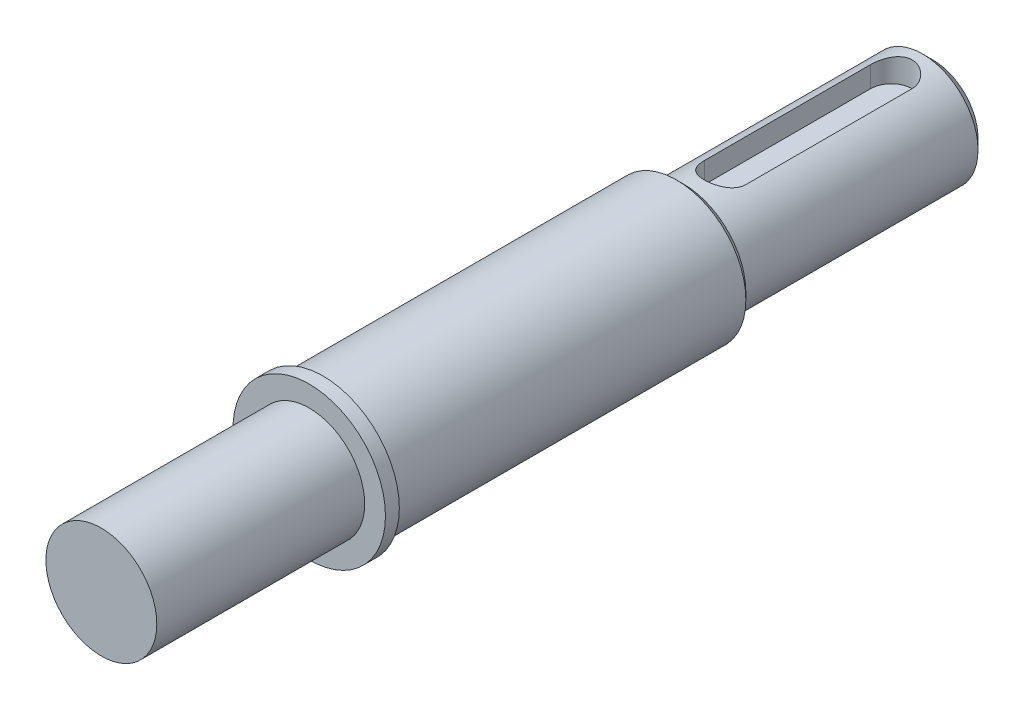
ISO-10303-21;
HEADER;
FILE_DESCRIPTION(('STEP AP214'),'2;1');
FILE_NAME('part.step','',(''),(''),'','','');
FILE_SCHEMA(('AUTOMOTIVE_DESIGN { 1 0 10303 214 1 1 1 1 }'));
ENDSEC;
DATA;
#1=APPLICATION_CONTEXT('core data for automotive mechanical design processes');
#2=APPLICATION_PROTOCOL_DEFINITION('international standard','automotive_design',2000,#1);
#3=PRODUCT_CONTEXT('',#1,'mechanical');
#4=PRODUCT('Part','Part','',(#3));
#5=PRODUCT_RELATED_PRODUCT_CATEGORY('part','',(#4));
#6=PRODUCT_DEFINITION_FORMATION('','',#4);
#7=PRODUCT_DEFINITION_CONTEXT('part definition',#1,'design');
#8=PRODUCT_DEFINITION('design','',#6,#7);
#9=PRODUCT_DEFINITION_SHAPE('','',#8);
#10=(LENGTH_UNIT() NAMED_UNIT(*) SI_UNIT(.MILLI.,.METRE.));
#11=(NAMED_UNIT(*) PLANE_ANGLE_UNIT() SI_UNIT($,.RADIAN.));
#12=(NAMED_UNIT(*) SI_UNIT($,.STERADIAN.) SOLID_ANGLE_UNIT());
#13=UNCERTAINTY_MEASURE_WITH_UNIT(LENGTH_MEASURE(1.E-05),#10,'distance_accuracy_value','');
#14=(GEOMETRIC_REPRESENTATION_CONTEXT(3) GLOBAL_UNCERTAINTY_ASSIGNED_CONTEXT((#13)) GLOBAL_UNIT_ASSIGNED_CONTEXT((#10,
#11,#12)) REPRESENTATION_CONTEXT('',''));
#15=CARTESIAN_POINT('',(0.,0.,0.));
#16=DIRECTION('',(0.,0.,1.));
#17=DIRECTION('',(1.,0.,0.));
#18=AXIS2_PLACEMENT_3D('',#15,#16,#17);
#19=CARTESIAN_POINT('',(0.,-5.34294830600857E-13,44.));
#20=DIRECTION('',(0.,0.,0.999999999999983));
#21=DIRECTION('',(1.,0.,0.));
#22=AXIS2_PLACEMENT_3D('',#19,#20,#21);
#23=PLANE('',#22);
#24=CARTESIAN_POINT('',(0.,-5.34294830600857E-13,44.));
#25=DIRECTION('',(0.,0.,0.999999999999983));
#26=DIRECTION('',(1.,0.,0.));
#27=AXIS2_PLACEMENT_3D('',#24,#25,#26);
#28=CIRCLE('',#27,5.5);
#29=CARTESIAN_POINT('',(5.5,-5.34294830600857E-13,44.));
#30=VERTEX_POINT('',#29);
#31=EDGE_CURVE('E106',#30,#30,#28,.T.);
#32=ORIENTED_EDGE('',*,*,#31,.F.);
#33=EDGE_LOOP('',(#32));
#34=FACE_BOUND('',#33,.T.);
#35=CARTESIAN_POINT('',(0.,-5.34294830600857E-13,44.));
#36=DIRECTION('',(0.,0.,0.999999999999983));
#37=DIRECTION('',(1.,0.,0.));
#38=AXIS2_PLACEMENT_3D('',#35,#36,#37);
#39=CIRCLE('',#38,5.);
#40=CARTESIAN_POINT('',(5.,-5.33888905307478E-13,44.));
#41=VERTEX_POINT('',#40);
#42=EDGE_CURVE('E192',#41,#41,#39,.F.);
#43=ORIENTED_EDGE('',*,*,#42,.F.);
#44=EDGE_LOOP('',(#43));
#45=FACE_BOUND('',#44,.T.);
#46=ADVANCED_FACE('F42',(#34,#45),#23,.F.);
#47=CARTESIAN_POINT('',(0.,-5.34294830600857E-13,44.));
#48=DIRECTION('',(0.,0.,0.999999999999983));
#49=DIRECTION('',(1.,0.,0.));
#50=AXIS2_PLACEMENT_3D('',#47,#48,#49);
#51=CYLINDRICAL_SURFACE('',#50,5.5);
#52=CARTESIAN_POINT('',(0.,-3.81639164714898E-13,45.0000000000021));
#53=DIRECTION('',(0.,0.,0.999999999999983));
#54=DIRECTION('',(1.,0.,0.));
#55=AXIS2_PLACEMENT_3D('',#52,#53,#54);
#56=CIRCLE('',#55,5.5);
#57=CARTESIAN_POINT('',(5.5,-5.34282687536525E-13,45.0000000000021));
#58=VERTEX_POINT('',#57);
#59=EDGE_CURVE('E109',#58,#58,#56,.T.);
#60=CARTESIAN_POINT('',(5.5,-5.34294830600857E-13,44.));
#61=CARTESIAN_POINT('',(5.5,-5.34294704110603E-13,44.0104166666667));
#62=CARTESIAN_POINT('',(5.5,-5.3429457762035E-13,44.0208333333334));
#63=CARTESIAN_POINT('',(5.5,-5.34294324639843E-13,44.0416666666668));
#64=CARTESIAN_POINT('',(5.5,-5.34294198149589E-13,44.0520833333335));
#65=CARTESIAN_POINT('',(5.5,-5.34293945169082E-13,44.0729166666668));
#66=CARTESIAN_POINT('',(5.5,-5.34293818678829E-13,44.0833333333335));
#67=CARTESIAN_POINT('',(5.5,-5.34293565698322E-13,44.1041666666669));
#68=CARTESIAN_POINT('',(5.5,-5.34293439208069E-13,44.1145833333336));
#69=CARTESIAN_POINT('',(5.5,-5.34293186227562E-13,44.135416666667));
#70=CARTESIAN_POINT('',(5.5,-5.34293059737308E-13,44.1458333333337));
#71=CARTESIAN_POINT('',(5.5,-5.34292806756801E-13,44.166666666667));
#72=CARTESIAN_POINT('',(5.5,-5.34292680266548E-13,44.1770833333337));
#73=CARTESIAN_POINT('',(5.5,-5.34292427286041E-13,44.1979166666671));
#74=CARTESIAN_POINT('',(5.5,-5.34292300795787E-13,44.2083333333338));
#75=CARTESIAN_POINT('',(5.5,-5.34292047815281E-13,44.2291666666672));
#76=CARTESIAN_POINT('',(5.5,-5.34291921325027E-13,44.2395833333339));
#77=CARTESIAN_POINT('',(5.5,-5.3429166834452E-13,44.2604166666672));
#78=CARTESIAN_POINT('',(5.5,-5.34291541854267E-13,44.2708333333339));
#79=CARTESIAN_POINT('',(5.5,-5.3429128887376E-13,44.2916666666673));
#80=CARTESIAN_POINT('',(5.5,-5.34291162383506E-13,44.302083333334));
#81=CARTESIAN_POINT('',(5.5,-5.34290909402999E-13,44.3229166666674));
#82=CARTESIAN_POINT('',(5.5,-5.34290782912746E-13,44.3333333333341));
#83=CARTESIAN_POINT('',(5.5,-5.34290529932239E-13,44.3541666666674));
#84=CARTESIAN_POINT('',(5.5,-5.34290403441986E-13,44.3645833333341));
#85=CARTESIAN_POINT('',(5.5,-5.34290150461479E-13,44.3854166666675));
#86=CARTESIAN_POINT('',(5.5,-5.34290023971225E-13,44.3958333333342));
#87=CARTESIAN_POINT('',(5.5,-5.34289770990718E-13,44.4166666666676));
#88=CARTESIAN_POINT('',(5.5,-5.34289644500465E-13,44.4270833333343));
#89=CARTESIAN_POINT('',(5.5,-5.34289391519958E-13,44.4479166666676));
#90=CARTESIAN_POINT('',(5.5,-5.34289265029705E-13,44.4583333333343));
#91=CARTESIAN_POINT('',(5.5,-5.34289012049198E-13,44.4791666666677));
#92=CARTESIAN_POINT('',(5.5,-5.34288885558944E-13,44.4895833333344));
#93=CARTESIAN_POINT('',(5.5,-5.34288632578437E-13,44.5104166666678));
#94=CARTESIAN_POINT('',(5.5,-5.34288506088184E-13,44.5208333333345));
#95=CARTESIAN_POINT('',(5.5,-5.34288253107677E-13,44.5416666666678));
#96=CARTESIAN_POINT('',(5.5,-5.34288126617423E-13,44.5520833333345));
#97=CARTESIAN_POINT('',(5.5,-5.34287873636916E-13,44.5729166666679));
#98=CARTESIAN_POINT('',(5.5,-5.34287747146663E-13,44.5833333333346));
#99=CARTESIAN_POINT('',(5.5,-5.34287494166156E-13,44.604166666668));
#100=CARTESIAN_POINT('',(5.5,-5.34287367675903E-13,44.6145833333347));
#101=CARTESIAN_POINT('',(5.5,-5.34287114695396E-13,44.635416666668));
#102=CARTESIAN_POINT('',(5.5,-5.34286988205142E-13,44.6458333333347));
#103=CARTESIAN_POINT('',(5.5,-5.34286735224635E-13,44.6666666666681));
#104=CARTESIAN_POINT('',(5.5,-5.34286608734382E-13,44.6770833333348));
#105=CARTESIAN_POINT('',(5.5,-5.34286355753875E-13,44.6979166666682));
#106=CARTESIAN_POINT('',(5.5,-5.34286229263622E-13,44.7083333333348));
#107=CARTESIAN_POINT('',(5.5,-5.34285976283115E-13,44.7291666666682));
#108=CARTESIAN_POINT('',(5.5,-5.34285849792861E-13,44.7395833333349));
#109=CARTESIAN_POINT('',(5.5,-5.34285596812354E-13,44.7604166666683));
#110=CARTESIAN_POINT('',(5.5,-5.34285470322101E-13,44.770833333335));
#111=CARTESIAN_POINT('',(5.5,-5.34285217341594E-13,44.7916666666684));
#112=CARTESIAN_POINT('',(5.5,-5.3428509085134E-13,44.802083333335));
#113=CARTESIAN_POINT('',(5.5,-5.34284837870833E-13,44.8229166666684));
#114=CARTESIAN_POINT('',(5.5,-5.3428471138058E-13,44.8333333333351));
#115=CARTESIAN_POINT('',(5.5,-5.34284458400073E-13,44.8541666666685));
#116=CARTESIAN_POINT('',(5.5,-5.3428433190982E-13,44.8645833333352));
#117=CARTESIAN_POINT('',(5.5,-5.34284078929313E-13,44.8854166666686));
#118=CARTESIAN_POINT('',(5.5,-5.34283952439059E-13,44.8958333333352));
#119=CARTESIAN_POINT('',(5.5,-5.34283699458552E-13,44.9166666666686));
#120=CARTESIAN_POINT('',(5.5,-5.34283572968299E-13,44.9270833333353));
#121=CARTESIAN_POINT('',(5.5,-5.34283319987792E-13,44.9479166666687));
#122=CARTESIAN_POINT('',(5.5,-5.34283193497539E-13,44.9583333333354));
#123=CARTESIAN_POINT('',(5.5,-5.34282940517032E-13,44.9791666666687));
#124=CARTESIAN_POINT('',(5.5,-5.34282814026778E-13,44.9895833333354));
#125=CARTESIAN_POINT('',(5.5,-5.34282687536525E-13,45.0000000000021));
#126=B_SPLINE_CURVE_WITH_KNOTS('',3,(#60,#61,#62,#63,#64,#65,#66,#67,#68,#69,#70,#71,#72,#73,
#74,#75,#76,#77,#78,#79,#80,#81,#82,#83,#84,#85,#86,#87,#88,#89,#90,#91,#92,#93,#94,#95,#96,#97,
#98,#99,#100,#101,#102,#103,#104,#105,#106,#107,#108,#109,#110,#111,#112,#113,#114,#115,#116,
#117,#118,#119,#120,#121,#122,#123,#124,#125),.UNSPECIFIED.,.F.,.F.,(4,2,2,2,2,2,2,2,2,2,2,2,2,
2,2,2,2,2,2,2,2,2,2,2,2,2,2,2,2,2,2,2,4),(0.,0.0312500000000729,0.0625000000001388,
0.0937500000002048,0.125000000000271,0.156250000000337,0.187500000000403,0.218750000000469,
0.250000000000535,0.2812500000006,0.312500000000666,0.343750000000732,0.375000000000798,
0.406250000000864,0.43750000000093,0.468750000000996,0.500000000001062,0.531250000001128,
0.562500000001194,0.59375000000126,0.625000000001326,0.656250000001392,0.687500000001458,
0.718750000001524,0.75000000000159,0.781250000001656,0.812500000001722,0.843750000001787,
0.875000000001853,0.906250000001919,0.937500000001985,0.968750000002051,1.00000000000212),.UNSPECIFIED.);
#127=EDGE_CURVE('BSEAM156',#30,#58,#126,.T.);
#128=ORIENTED_EDGE('',*,*,#31,.T.);
#129=ORIENTED_EDGE('',*,*,#59,.F.);
#130=ORIENTED_EDGE('',*,*,#127,.T.);
#131=ORIENTED_EDGE('',*,*,#127,.F.);
#132=EDGE_LOOP('',(#128,#130,#129,#131));
#133=FACE_BOUND('',#132,.T.);
#134=ADVANCED_FACE('F156',(#133),#51,.T.);
#135=CARTESIAN_POINT('',(0.,-3.81639164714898E-13,45.0000000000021));
#136=DIRECTION('',(0.,0.,0.999999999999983));
#137=DIRECTION('',(1.,0.,0.));
#138=AXIS2_PLACEMENT_3D('',#135,#136,#137);
#139=PLANE('',#138);
#140=CARTESIAN_POINT('',(0.,-3.81639164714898E-13,45.0000000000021));
#141=DIRECTION('',(0.,0.,0.999999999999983));
#142=DIRECTION('',(1.,0.,0.));
#143=AXIS2_PLACEMENT_3D('',#140,#141,#142);
#144=CIRCLE('',#143,4.);
#145=CARTESIAN_POINT('',(4.,0.,45.0000000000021));
#146=VERTEX_POINT('',#145);
#147=EDGE_CURVE('E12',#146,#146,#144,.T.);
#148=ORIENTED_EDGE('',*,*,#147,.F.);
#149=EDGE_LOOP('',(#148));
#150=FACE_BOUND('',#149,.T.);
#151=ORIENTED_EDGE('',*,*,#59,.T.);
#152=EDGE_LOOP('',(#151));
#153=FACE_BOUND('',#152,.T.);
#154=ADVANCED_FACE('F164',(#150,#153),#139,.T.);
#155=CARTESIAN_POINT('',(0.,-5.34294830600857E-13,18.));
#156=DIRECTION('',(0.,0.,-0.999999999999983));
#157=DIRECTION('',(-1.,0.,0.));
#158=AXIS2_PLACEMENT_3D('',#155,#156,#157);
#159=PLANE('',#158);
#160=CARTESIAN_POINT('',(0.,-5.34294830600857E-13,18.));
#161=DIRECTION('',(0.,0.,-0.999999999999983));
#162=DIRECTION('',(-1.,0.,0.));
#163=AXIS2_PLACEMENT_3D('',#160,#161,#162);
#164=CIRCLE('',#163,4.5);
#165=CARTESIAN_POINT('',(4.5,-5.34294830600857E-13,18.));
#166=VERTEX_POINT('',#165);
#167=EDGE_CURVE('E193',#166,#166,#164,.T.);
#168=ORIENTED_EDGE('',*,*,#167,.T.);
#169=EDGE_LOOP('',(#168));
#170=FACE_BOUND('',#169,.T.);
#171=CARTESIAN_POINT('',(0.,-5.34294830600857E-13,18.));
#172=DIRECTION('',(0.,0.,-0.999999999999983));
#173=DIRECTION('',(-1.,0.,0.));
#174=AXIS2_PLACEMENT_3D('',#171,#172,#173);
#175=CIRCLE('',#174,4.);
#176=CARTESIAN_POINT('',(-4.,-5.34294830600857E-13,18.));
#177=VERTEX_POINT('',#176);
#178=EDGE_CURVE('E203',#177,#177,#175,.T.);
#179=ORIENTED_EDGE('',*,*,#178,.F.);
#180=EDGE_LOOP('',(#179));
#181=FACE_BOUND('',#180,.T.);
#182=ADVANCED_FACE('F174',(#170,#181),#159,.T.);
#183=CARTESIAN_POINT('',(0.,-5.34294830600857E-13,18.));
#184=DIRECTION('',(0.,0.,0.999999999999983));
#185=DIRECTION('',(1.,0.,0.));
#186=AXIS2_PLACEMENT_3D('',#183,#184,#185);
#187=CYLINDRICAL_SURFACE('',#186,5.);
#188=CARTESIAN_POINT('',(0.,-3.33066907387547E-13,18.5000000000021));
#189=DIRECTION('',(0.,0.,-0.999999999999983));
#190=DIRECTION('',(-1.,0.,0.));
#191=AXIS2_PLACEMENT_3D('',#188,#189,#190);
#192=CIRCLE('',#191,5.);
#193=CARTESIAN_POINT('',(5.,-5.34287024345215E-13,18.5000000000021));
#194=VERTEX_POINT('',#193);
#195=EDGE_CURVE('E51',#194,#194,#192,.F.);
#196=CARTESIAN_POINT('',(5.,-5.34287024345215E-13,18.5000000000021));
#197=CARTESIAN_POINT('',(5.,-5.34282877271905E-13,18.7656250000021));
#198=CARTESIAN_POINT('',(5.,-5.34278730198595E-13,19.0312500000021));
#199=CARTESIAN_POINT('',(5.,-5.34270436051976E-13,19.562500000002));
#200=CARTESIAN_POINT('',(5.,-5.34266288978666E-13,19.828125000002));
#201=CARTESIAN_POINT('',(5.,-5.34257994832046E-13,20.359375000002));
#202=CARTESIAN_POINT('',(5.,-5.34253847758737E-13,20.625000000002));
#203=CARTESIAN_POINT('',(5.,-5.34245553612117E-13,21.1562500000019));
#204=CARTESIAN_POINT('',(5.,-5.34241406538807E-13,21.4218750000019));
#205=CARTESIAN_POINT('',(5.,-5.34233112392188E-13,21.9531250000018));
#206=CARTESIAN_POINT('',(5.,-5.34228965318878E-13,22.2187500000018));
#207=CARTESIAN_POINT('',(5.,-5.34220671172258E-13,22.7500000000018));
#208=CARTESIAN_POINT('',(5.,-5.34216524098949E-13,23.0156250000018));
#209=CARTESIAN_POINT('',(5.,-5.34208229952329E-13,23.5468750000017));
#210=CARTESIAN_POINT('',(5.,-5.3420408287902E-13,23.8125000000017));
#211=CARTESIAN_POINT('',(5.,-5.341957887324E-13,24.3437500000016));
#212=CARTESIAN_POINT('',(5.,-5.3419164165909E-13,24.6093750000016));
#213=CARTESIAN_POINT('',(5.,-5.34183347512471E-13,25.1406250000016));
#214=CARTESIAN_POINT('',(5.,-5.34179200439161E-13,25.4062500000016));
#215=CARTESIAN_POINT('',(5.,-5.34170906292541E-13,25.9375000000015));
#216=CARTESIAN_POINT('',(5.,-5.34166759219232E-13,26.2031250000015));
#217=CARTESIAN_POINT('',(5.,-5.34158465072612E-13,26.7343750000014));
#218=CARTESIAN_POINT('',(5.,-5.34154317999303E-13,27.0000000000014));
#219=CARTESIAN_POINT('',(5.,-5.34146023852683E-13,27.5312500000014));
#220=CARTESIAN_POINT('',(5.,-5.34141876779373E-13,27.7968750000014));
#221=CARTESIAN_POINT('',(5.,-5.34133582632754E-13,28.3281250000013));
#222=CARTESIAN_POINT('',(5.,-5.34129435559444E-13,28.5937500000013));
#223=CARTESIAN_POINT('',(5.,-5.34121141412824E-13,29.1250000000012));
#224=CARTESIAN_POINT('',(5.,-5.34116994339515E-13,29.3906250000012));
#225=CARTESIAN_POINT('',(5.,-5.34108700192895E-13,29.9218750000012));
#226=CARTESIAN_POINT('',(5.,-5.34104553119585E-13,30.1875000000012));
#227=CARTESIAN_POINT('',(5.,-5.34096258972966E-13,30.7187500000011));
#228=CARTESIAN_POINT('',(5.,-5.34092111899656E-13,30.9843750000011));
#229=CARTESIAN_POINT('',(5.,-5.34083817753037E-13,31.515625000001));
#230=CARTESIAN_POINT('',(5.,-5.34079670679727E-13,31.781250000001));
#231=CARTESIAN_POINT('',(5.,-5.34071376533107E-13,32.312500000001));
#232=CARTESIAN_POINT('',(5.,-5.34067229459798E-13,32.578125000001));
#233=CARTESIAN_POINT('',(5.,-5.34058935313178E-13,33.1093750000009));
#234=CARTESIAN_POINT('',(5.,-5.34054788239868E-13,33.3750000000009));
#235=CARTESIAN_POINT('',(5.,-5.34046494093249E-13,33.9062500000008));
#236=CARTESIAN_POINT('',(5.,-5.34042347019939E-13,34.1718750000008));
#237=CARTESIAN_POINT('',(5.,-5.3403405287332E-13,34.7031250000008));
#238=CARTESIAN_POINT('',(5.,-5.3402990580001E-13,34.9687500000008));
#239=CARTESIAN_POINT('',(5.,-5.3402161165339E-13,35.5000000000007));
#240=CARTESIAN_POINT('',(5.,-5.3401746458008E-13,35.7656250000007));
#241=CARTESIAN_POINT('',(5.,-5.34009170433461E-13,36.2968750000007));
#242=CARTESIAN_POINT('',(5.,-5.34005023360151E-13,36.5625000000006));
#243=CARTESIAN_POINT('',(5.,-5.33996729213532E-13,37.0937500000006));
#244=CARTESIAN_POINT('',(5.,-5.33992582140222E-13,37.3593750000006));
#245=CARTESIAN_POINT('',(5.,-5.33984287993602E-13,37.8906250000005));
#246=CARTESIAN_POINT('',(5.,-5.33980140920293E-13,38.1562500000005));
#247=CARTESIAN_POINT('',(5.,-5.33971846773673E-13,38.6875000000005));
#248=CARTESIAN_POINT('',(5.,-5.33967699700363E-13,38.9531250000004));
#249=CARTESIAN_POINT('',(5.,-5.33959405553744E-13,39.4843750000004));
#250=CARTESIAN_POINT('',(5.,-5.33955258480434E-13,39.7500000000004));
#251=CARTESIAN_POINT('',(5.,-5.33946964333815E-13,40.2812500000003));
#252=CARTESIAN_POINT('',(5.,-5.33942817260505E-13,40.5468750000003));
#253=CARTESIAN_POINT('',(5.,-5.33934523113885E-13,41.0781250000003));
#254=CARTESIAN_POINT('',(5.,-5.33930376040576E-13,41.3437500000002));
#255=CARTESIAN_POINT('',(5.,-5.33922081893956E-13,41.8750000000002));
#256=CARTESIAN_POINT('',(5.,-5.33917934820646E-13,42.1406250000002));
#257=CARTESIAN_POINT('',(5.,-5.33909640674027E-13,42.6718750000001));
#258=CARTESIAN_POINT('',(5.,-5.33905493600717E-13,42.9375000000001));
#259=CARTESIAN_POINT('',(5.,-5.33897199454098E-13,43.4687500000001));
#260=CARTESIAN_POINT('',(5.,-5.33893052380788E-13,43.734375));
#261=CARTESIAN_POINT('',(5.,-5.33888905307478E-13,44.));
#262=B_SPLINE_CURVE_WITH_KNOTS('',3,(#196,#197,#198,#199,#200,#201,#202,#203,#204,#205,#206,
#207,#208,#209,#210,#211,#212,#213,#214,#215,#216,#217,#218,#219,#220,#221,#222,#223,#224,#225,
#226,#227,#228,#229,#230,#231,#232,#233,#234,#235,#236,#237,#238,#239,#240,#241,#242,#243,#244,
#245,#246,#247,#248,#249,#250,#251,#252,#253,#254,#255,#256,#257,#258,#259,#260,#261),
.UNSPECIFIED.,.F.,.F.,(4,2,2,2,2,2,2,2,2,2,2,2,2,2,2,2,2,2,2,2,2,2,2,2,2,2,2,2,2,2,2,2,4),(0.,
0.796874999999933,1.59374999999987,2.3906249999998,3.18749999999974,3.98437499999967,
4.7812499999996,5.57812499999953,6.37499999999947,7.1718749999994,7.96874999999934,
8.76562499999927,9.56249999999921,10.3593749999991,11.1562499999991,11.953124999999,
12.7499999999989,13.5468749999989,14.3437499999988,15.1406249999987,15.9374999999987,
16.7343749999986,17.5312499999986,18.3281249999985,19.1249999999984,19.9218749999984,
20.7187499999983,21.5156249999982,22.3124999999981,23.1093749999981,23.906249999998,
24.703124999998,25.4999999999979),.UNSPECIFIED.);
#263=EDGE_CURVE('BSEAM170',#194,#41,#262,.T.);
#264=ORIENTED_EDGE('',*,*,#195,.T.);
#265=ORIENTED_EDGE('',*,*,#42,.T.);
#266=ORIENTED_EDGE('',*,*,#263,.T.);
#267=ORIENTED_EDGE('',*,*,#263,.F.);
#268=EDGE_LOOP('',(#264,#266,#265,#267));
#269=FACE_BOUND('',#268,.T.);
#270=ADVANCED_FACE('F170',(#269),#187,.T.);
#271=CARTESIAN_POINT('',(0.,2.2,3.));
#272=DIRECTION('',(0.,-1.,0.));
#273=DIRECTION('',(0.,0.,-0.999999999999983));
#274=AXIS2_PLACEMENT_3D('',#271,#272,#273);
#275=PLANE('',#274);
#276=CARTESIAN_POINT('',(0.,2.2,3.));
#277=DIRECTION('',(0.,1.,0.));
#278=DIRECTION('',(0.,0.,-0.999999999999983));
#279=AXIS2_PLACEMENT_3D('',#276,#277,#278);
#280=CIRCLE('',#279,1.5);
#281=CARTESIAN_POINT('',(1.5,2.2,3.));
#282=VERTEX_POINT('',#281);
#283=CARTESIAN_POINT('',(-1.5,2.2,3.));
#284=VERTEX_POINT('',#283);
#285=EDGE_CURVE('E87',#282,#284,#280,.T.);
#286=ORIENTED_EDGE('',*,*,#285,.T.);
#287=DIRECTION('',(0.,0.,0.999999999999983));
#288=VECTOR('',#287,1.);
#289=CARTESIAN_POINT('',(-1.5,2.2,3.));
#290=LINE('',#289,#288);
#291=CARTESIAN_POINT('',(-1.5,2.19999999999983,15.0000000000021));
#292=VERTEX_POINT('',#291);
#293=EDGE_CURVE('E95',#284,#292,#290,.T.);
#294=ORIENTED_EDGE('',*,*,#293,.T.);
#295=CARTESIAN_POINT('',(0.,2.19999999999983,15.0000000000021));
#296=DIRECTION('',(0.,1.,0.));
#297=DIRECTION('',(0.,0.,0.999999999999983));
#298=AXIS2_PLACEMENT_3D('',#295,#296,#297);
#299=CIRCLE('',#298,1.5);
#300=CARTESIAN_POINT('',(1.5,2.19999999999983,15.0000000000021));
#301=VERTEX_POINT('',#300);
#302=EDGE_CURVE('E101',#292,#301,#299,.T.);
#303=ORIENTED_EDGE('',*,*,#302,.T.);
#304=DIRECTION('',(0.,0.,-0.999999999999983));
#305=VECTOR('',#304,1.);
#306=CARTESIAN_POINT('',(1.5,2.2,3.));
#307=LINE('',#306,#305);
#308=EDGE_CURVE('E105',#301,#282,#307,.T.);
#309=ORIENTED_EDGE('',*,*,#308,.T.);
#310=EDGE_LOOP('',(#286,#294,#303,#309));
#311=FACE_BOUND('',#310,.T.);
#312=ADVANCED_FACE('F104',(#311),#275,.F.);
#313=CARTESIAN_POINT('',(0.,0.,0.));
#314=DIRECTION('',(0.,0.,0.999999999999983));
#315=DIRECTION('',(1.,0.,0.));
#316=AXIS2_PLACEMENT_3D('',#313,#314,#315);
#317=PLANE('',#316);
#318=CARTESIAN_POINT('',(0.,0.,0.));
#319=DIRECTION('',(0.,0.,0.999999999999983));
#320=DIRECTION('',(1.,0.,0.));
#321=AXIS2_PLACEMENT_3D('',#318,#319,#320);
#322=CIRCLE('',#321,3.25);
#323=CARTESIAN_POINT('',(3.24999999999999,0.,0.));
#324=VERTEX_POINT('',#323);
#325=EDGE_CURVE('E194',#324,#324,#322,.F.);
#326=ORIENTED_EDGE('',*,*,#325,.T.);
#327=EDGE_LOOP('',(#326));
#328=FACE_BOUND('',#327,.T.);
#329=ADVANCED_FACE('F133',(#328),#317,.F.);
#330=CARTESIAN_POINT('',(0.,3.99999999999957,15.0000000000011));
#331=DIRECTION('',(0.,-1.,0.));
#332=DIRECTION('',(0.,0.,-0.999999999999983));
#333=AXIS2_PLACEMENT_3D('',#330,#331,#332);
#334=CYLINDRICAL_SURFACE('',#333,1.5);
#335=DIRECTION('',(0.,-1.,0.));
#336=VECTOR('',#335,1.);
#337=CARTESIAN_POINT('',(-1.5,3.99999999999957,15.0000000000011));
#338=LINE('',#337,#336);
#339=CARTESIAN_POINT('',(-1.5,3.70809924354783,15.));
#340=VERTEX_POINT('',#339);
#341=EDGE_CURVE('E92',#340,#292,#338,.T.);
#342=ORIENTED_EDGE('',*,*,#341,.F.);
#343=CARTESIAN_POINT('',(0.,3.99999999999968,13.5000000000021));
#344=CARTESIAN_POINT('',(-0.0812350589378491,4.0000021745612,13.499997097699));
#345=CARTESIAN_POINT('',(-0.162450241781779,3.99750379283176,13.50661976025));
#346=CARTESIAN_POINT('',(-0.322453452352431,3.98778696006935,13.5328281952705));
#347=CARTESIAN_POINT('',(-0.401241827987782,3.98056918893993,13.5524121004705));
#348=CARTESIAN_POINT('',(-0.55406078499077,3.96218832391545,13.6037530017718));
#349=CARTESIAN_POINT('',(-0.628100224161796,3.95103284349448,13.6354865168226));
#350=CARTESIAN_POINT('',(-0.769799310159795,3.92588767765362,13.7101064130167));
#351=CARTESIAN_POINT('',(-0.837457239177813,3.91189723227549,13.7529957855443));
#352=CARTESIAN_POINT('',(-0.967346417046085,3.88186246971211,13.8506125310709));
#353=CARTESIAN_POINT('',(-1.02927073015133,3.86576002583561,13.90573026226));
#354=CARTESIAN_POINT('',(-1.14324421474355,3.83360220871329,14.0254104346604));
#355=CARTESIAN_POINT('',(-1.19529036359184,3.81754685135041,14.0899757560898));
#356=CARTESIAN_POINT('',(-1.28998202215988,3.78662470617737,14.2297174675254));
#357=CARTESIAN_POINT('',(-1.33219393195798,3.77182648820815,14.3052043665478));
#358=CARTESIAN_POINT('',(-1.40318646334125,3.74599860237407,14.4628483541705));
#359=CARTESIAN_POINT('',(-1.43197244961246,3.73496742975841,14.5450027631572));
#360=CARTESIAN_POINT('',(-1.47408431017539,3.71854412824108,14.7101167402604));
#361=CARTESIAN_POINT('',(-1.48799593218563,3.71293924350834,14.7929050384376));
#362=CARTESIAN_POINT('',(-1.50179556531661,3.70738061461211,14.959816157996));
#363=CARTESIAN_POINT('',(-1.50168936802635,3.70742453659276,15.0439384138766));
#364=CARTESIAN_POINT('',(-1.48790429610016,3.71297511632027,15.2057695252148));
#365=CARTESIAN_POINT('',(-1.47503808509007,3.71815468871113,15.2835609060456));
#366=CARTESIAN_POINT('',(-1.43744167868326,3.73284938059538,15.435787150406));
#367=CARTESIAN_POINT('',(-1.4127096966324,3.74236515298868,15.5102215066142));
#368=CARTESIAN_POINT('',(-1.35163748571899,3.76485702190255,15.6552770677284));
#369=CARTESIAN_POINT('',(-1.31508648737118,3.7778951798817,15.7257994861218));
#370=CARTESIAN_POINT('',(-1.23156073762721,3.80594210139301,15.8599457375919));
#371=CARTESIAN_POINT('',(-1.18458238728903,3.82095154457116,15.9235671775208));
#372=CARTESIAN_POINT('',(-1.07781780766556,3.85248038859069,16.046603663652));
#373=CARTESIAN_POINT('',(-1.01738298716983,3.86903347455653,16.1054486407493));
#374=CARTESIAN_POINT('',(-0.887312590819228,3.90091728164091,16.2123379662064));
#375=CARTESIAN_POINT('',(-0.817675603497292,3.91624781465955,16.2603806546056));
#376=CARTESIAN_POINT('',(-0.669723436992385,3.94426394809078,16.3449303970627));
#377=CARTESIAN_POINT('',(-0.591290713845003,3.95690498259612,16.3812475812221));
#378=CARTESIAN_POINT('',(-0.428836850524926,3.97778718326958,16.4399826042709));
#379=CARTESIAN_POINT('',(-0.344818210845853,3.98603030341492,16.462406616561));
#380=CARTESIAN_POINT('',(-0.178375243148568,3.99684443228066,16.491622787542));
#381=CARTESIAN_POINT('',(-0.0961036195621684,3.99969369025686,16.4991826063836));
#382=CARTESIAN_POINT('',(0.0685724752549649,4.00025893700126,16.500691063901));
#383=CARTESIAN_POINT('',(0.15097691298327,3.99797606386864,16.4946427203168));
#384=CARTESIAN_POINT('',(0.310262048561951,3.98871709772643,16.4696899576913));
#385=CARTESIAN_POINT('',(0.387233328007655,3.98192470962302,16.4512884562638));
#386=CARTESIAN_POINT('',(0.536941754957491,3.96451477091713,16.4028139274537));
#387=CARTESIAN_POINT('',(0.609678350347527,3.95389672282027,16.3727393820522));
#388=CARTESIAN_POINT('',(0.751247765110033,3.92949624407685,16.3008135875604));
#389=CARTESIAN_POINT('',(0.819903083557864,3.91563000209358,16.2586422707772));
#390=CARTESIAN_POINT('',(0.949392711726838,3.88626671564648,16.1640818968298));
#391=CARTESIAN_POINT('',(1.01022412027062,3.87076907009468,16.1116890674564));
#392=CARTESIAN_POINT('',(1.12603079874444,3.83873329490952,15.9945958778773));
#393=CARTESIAN_POINT('',(1.18046154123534,3.82218696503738,15.9293578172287));
#394=CARTESIAN_POINT('',(1.27771050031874,3.79078815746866,15.790348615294));
#395=CARTESIAN_POINT('',(1.32052767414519,3.77593583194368,15.7165767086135));
#396=CARTESIAN_POINT('',(1.39337773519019,3.7496682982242,15.5619840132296));
#397=CARTESIAN_POINT('',(1.42335685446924,3.73826760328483,15.481135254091));
#398=CARTESIAN_POINT('',(1.46907883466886,3.72054032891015,15.3149902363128));
#399=CARTESIAN_POINT('',(1.48483050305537,3.71421061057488,15.2296967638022));
#400=CARTESIAN_POINT('',(1.50086347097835,3.70775894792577,15.0629838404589));
#401=CARTESIAN_POINT('',(1.50207331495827,3.70726444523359,14.9816673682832));
#402=CARTESIAN_POINT('',(1.49136715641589,3.7115841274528,14.8200546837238));
#403=CARTESIAN_POINT('',(1.47945239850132,3.71639780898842,14.7397583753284));
#404=CARTESIAN_POINT('',(1.44355815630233,3.73048141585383,14.5849527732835));
#405=CARTESIAN_POINT('',(1.41995798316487,3.73961085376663,14.5103416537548));
#406=CARTESIAN_POINT('',(1.36169696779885,3.76121548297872,14.3660944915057));
#407=CARTESIAN_POINT('',(1.32703332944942,3.77369151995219,14.2964597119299));
#408=CARTESIAN_POINT('',(1.24552075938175,3.80139723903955,14.1601732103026));
#409=CARTESIAN_POINT('',(1.19812832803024,3.81673698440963,14.0938692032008));
#410=CARTESIAN_POINT('',(1.09334485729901,3.84806246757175,13.9698584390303));
#411=CARTESIAN_POINT('',(1.03595064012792,3.86404840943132,13.9121544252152));
#412=CARTESIAN_POINT('',(0.909080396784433,3.89590424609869,13.8037980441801));
#413=CARTESIAN_POINT('',(0.839118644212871,3.91172104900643,13.7536962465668));
#414=CARTESIAN_POINT('',(0.691213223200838,3.94054514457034,13.665977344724));
#415=CARTESIAN_POINT('',(0.613268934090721,3.95355221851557,13.6283612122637));
#416=CARTESIAN_POINT('',(0.447999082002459,3.97574292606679,13.5656231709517));
#417=CARTESIAN_POINT('',(0.360413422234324,3.98473657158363,13.5411129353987));
#418=CARTESIAN_POINT('',(0.18187573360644,3.99686242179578,13.5083070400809));
#419=CARTESIAN_POINT('',(0.0909254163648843,3.99999756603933,13.5000032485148));
#420=CARTESIAN_POINT('',(0.,3.99999999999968,13.5000000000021));
#421=B_SPLINE_CURVE_WITH_KNOTS('',3,(#343,#344,#345,#346,#347,#348,#349,#350,#351,#352,#353,
#354,#355,#356,#357,#358,#359,#360,#361,#362,#363,#364,#365,#366,#367,#368,#369,#370,#371,#372,
#373,#374,#375,#376,#377,#378,#379,#380,#381,#382,#383,#384,#385,#386,#387,#388,#389,#390,#391,
#392,#393,#394,#395,#396,#397,#398,#399,#400,#401,#402,#403,#404,#405,#406,#407,#408,#409,#410,
#411,#412,#413,#414,#415,#416,#417,#418,#419,#420),.UNSPECIFIED.,.T.,.F.,(4,2,2,2,2,2,2,2,2,2,2,
2,2,2,2,2,2,2,2,2,2,2,2,2,2,2,2,2,2,2,2,2,2,2,2,2,2,2,4),(0.,0.24336980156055,0.486704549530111,
0.729571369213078,0.972503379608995,1.2247361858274,1.47704604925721,1.73896674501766,
2.00078269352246,2.25185874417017,2.50283106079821,2.73878345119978,2.974771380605,
3.21522408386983,3.45575990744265,3.71246153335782,3.96920257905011,4.22991375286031,
4.49050899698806,4.73725019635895,4.98393668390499,5.22114437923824,5.45838293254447,
5.70259221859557,5.94689180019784,6.20536519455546,6.46386178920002,6.72343066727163,
6.98283874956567,7.22558763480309,7.46831350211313,7.70363142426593,7.9390088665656,
8.18672471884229,8.43451941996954,8.69572329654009,8.95694749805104,9.22948515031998,
9.5018860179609),.UNSPECIFIED.);
#422=CARTESIAN_POINT('',(1.5,3.70809924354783,15.));
#423=VERTEX_POINT('',#422);
#424=EDGE_CURVE('E91',#340,#423,#421,.T.);
#425=ORIENTED_EDGE('',*,*,#424,.T.);
#426=DIRECTION('',(0.,-1.,0.));
#427=VECTOR('',#426,1.);
#428=CARTESIAN_POINT('',(1.5,3.99999999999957,15.0000000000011));
#429=LINE('',#428,#427);
#430=EDGE_CURVE('E58',#423,#301,#429,.T.);
#431=ORIENTED_EDGE('',*,*,#430,.T.);
#432=ORIENTED_EDGE('',*,*,#302,.F.);
#433=EDGE_LOOP('',(#342,#425,#431,#432));
#434=FACE_BOUND('',#433,.T.);
#435=ADVANCED_FACE('F127',(#434),#334,.F.);
#436=CARTESIAN_POINT('',(1.5,3.99999999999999,2.99999999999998));
#437=DIRECTION('',(-1.,0.,0.));
#438=DIRECTION('',(0.,0.,0.999999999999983));
#439=AXIS2_PLACEMENT_3D('',#436,#437,#438);
#440=PLANE('',#439);
#441=DIRECTION('',(0.,0.,-0.999999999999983));
#442=VECTOR('',#441,1.);
#443=CARTESIAN_POINT('',(1.5,3.70809924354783,60.));
#444=LINE('',#443,#442);
#445=CARTESIAN_POINT('',(1.5,3.70809924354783,3.));
#446=VERTEX_POINT('',#445);
#447=EDGE_CURVE('E223',#423,#446,#444,.T.);
#448=ORIENTED_EDGE('',*,*,#447,.T.);
#449=DIRECTION('',(0.,-1.,0.));
#450=VECTOR('',#449,1.);
#451=CARTESIAN_POINT('',(1.5,3.99999999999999,2.99999999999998));
#452=LINE('',#451,#450);
#453=EDGE_CURVE('E115',#446,#282,#452,.T.);
#454=ORIENTED_EDGE('',*,*,#453,.T.);
#455=ORIENTED_EDGE('',*,*,#308,.F.);
#456=ORIENTED_EDGE('',*,*,#430,.F.);
#457=EDGE_LOOP('',(#448,#454,#455,#456));
#458=FACE_BOUND('',#457,.T.);
#459=ADVANCED_FACE('F132',(#458),#440,.T.);
#460=CARTESIAN_POINT('',(0.,3.99999999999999,3.));
#461=DIRECTION('',(0.,-1.,0.));
#462=DIRECTION('',(0.,0.,-0.999999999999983));
#463=AXIS2_PLACEMENT_3D('',#460,#461,#462);
#464=CYLINDRICAL_SURFACE('',#463,1.5);
#465=CARTESIAN_POINT('',(0.,3.99999999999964,1.50000000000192));
#466=CARTESIAN_POINT('',(-0.0812350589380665,4.00000217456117,1.49999709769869));
#467=CARTESIAN_POINT('',(-0.162450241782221,3.99750379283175,1.50661976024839));
#468=CARTESIAN_POINT('',(-0.322453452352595,3.98778696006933,1.53282819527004));
#469=CARTESIAN_POINT('',(-0.40124182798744,3.98056918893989,1.55241210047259));
#470=CARTESIAN_POINT('',(-0.554060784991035,3.96218832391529,1.603753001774));
#471=CARTESIAN_POINT('',(-0.628100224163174,3.95103284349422,1.63548651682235));
#472=CARTESIAN_POINT('',(-0.769799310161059,3.92588767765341,1.71010641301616));
#473=CARTESIAN_POINT('',(-0.837457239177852,3.91189723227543,1.75299578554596));
#474=CARTESIAN_POINT('',(-0.967346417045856,3.88186246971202,1.85061253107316));
#475=CARTESIAN_POINT('',(-1.02927073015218,3.86576002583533,1.90573026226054));
#476=CARTESIAN_POINT('',(-1.14324421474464,3.83360220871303,2.02541043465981));
#477=CARTESIAN_POINT('',(-1.19529036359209,3.81754685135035,2.08997575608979));
#478=CARTESIAN_POINT('',(-1.28998202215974,3.78662470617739,2.2297174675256));
#479=CARTESIAN_POINT('',(-1.33219393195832,3.77182648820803,2.30520436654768));
#480=CARTESIAN_POINT('',(-1.4031864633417,3.74599860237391,2.4628483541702));
#481=CARTESIAN_POINT('',(-1.43197244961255,3.73496742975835,2.54500276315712));
#482=CARTESIAN_POINT('',(-1.47408431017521,3.71854412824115,2.7101167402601));
#483=CARTESIAN_POINT('',(-1.48799593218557,3.71293924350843,2.79290503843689));
#484=CARTESIAN_POINT('',(-1.50179556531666,3.70738061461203,2.95981615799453));
#485=CARTESIAN_POINT('',(-1.50168936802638,3.7074245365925,3.04393841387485));
#486=CARTESIAN_POINT('',(-1.48790429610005,3.71297511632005,3.20576952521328));
#487=CARTESIAN_POINT('',(-1.47503808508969,3.71815468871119,3.28356090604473));
#488=CARTESIAN_POINT('',(-1.43744167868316,3.7328493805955,3.43578715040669));
#489=CARTESIAN_POINT('',(-1.41270969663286,3.74236515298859,3.51022150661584));
#490=CARTESIAN_POINT('',(-1.3516374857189,3.76485702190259,3.6552770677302));
#491=CARTESIAN_POINT('',(-1.31508648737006,3.77789517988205,3.7257994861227));
#492=CARTESIAN_POINT('',(-1.23156073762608,3.80594210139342,3.85994573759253));
#493=CARTESIAN_POINT('',(-1.18458238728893,3.82095154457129,3.923567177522));
#494=CARTESIAN_POINT('',(-1.07781780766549,3.85248038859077,4.04660366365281));
#495=CARTESIAN_POINT('',(-1.01738298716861,3.86903347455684,4.1054486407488));
#496=CARTESIAN_POINT('',(-0.887312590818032,3.90091728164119,4.21233796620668));
#497=CARTESIAN_POINT('',(-0.817675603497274,3.91624781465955,4.26038065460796));
#498=CARTESIAN_POINT('',(-0.669723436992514,3.94426394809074,4.34493039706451));
#499=CARTESIAN_POINT('',(-0.591290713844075,3.95690498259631,4.3812475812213));
#500=CARTESIAN_POINT('',(-0.428836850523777,3.97778718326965,4.43998260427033));
#501=CARTESIAN_POINT('',(-0.344818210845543,3.98603030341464,4.46240661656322));
#502=CARTESIAN_POINT('',(-0.178375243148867,3.99684443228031,4.49162278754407));
#503=CARTESIAN_POINT('',(-0.0961036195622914,3.99969369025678,4.49918260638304));
#504=CARTESIAN_POINT('',(0.0685724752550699,4.00025893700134,4.50069106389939));
#505=CARTESIAN_POINT('',(0.150976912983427,3.99797606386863,4.49464272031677));
#506=CARTESIAN_POINT('',(0.310262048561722,3.98871709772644,4.46968995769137));
#507=CARTESIAN_POINT('',(0.387233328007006,3.98192470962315,4.45128845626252));
#508=CARTESIAN_POINT('',(0.536941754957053,3.96451477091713,4.40281392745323));
#509=CARTESIAN_POINT('',(0.609678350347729,3.95389672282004,4.37273938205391));
#510=CARTESIAN_POINT('',(0.751247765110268,3.92949624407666,4.30081358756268));
#511=CARTESIAN_POINT('',(0.819903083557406,3.91563000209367,4.25864227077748));
#512=CARTESIAN_POINT('',(0.949392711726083,3.88626671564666,4.16408189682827));
#513=CARTESIAN_POINT('',(1.01022412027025,3.87076907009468,4.11168906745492));
#514=CARTESIAN_POINT('',(1.12603079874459,3.83873329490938,3.99459587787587));
#515=CARTESIAN_POINT('',(1.18046154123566,3.8221869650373,3.92935781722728));
#516=CARTESIAN_POINT('',(1.277710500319,3.79078815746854,3.79034861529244));
#517=CARTESIAN_POINT('',(1.32052767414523,3.77593583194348,3.7165767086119));
#518=CARTESIAN_POINT('',(1.39337773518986,3.74966829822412,3.56198401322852));
#519=CARTESIAN_POINT('',(1.42335685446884,3.73826760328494,3.48113525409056));
#520=CARTESIAN_POINT('',(1.46907883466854,3.72054032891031,3.31499023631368));
#521=CARTESIAN_POINT('',(1.48483050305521,3.71421061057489,3.22969676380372));
#522=CARTESIAN_POINT('',(1.50086347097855,3.70775894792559,3.06298384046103));
#523=CARTESIAN_POINT('',(1.5020733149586,3.70726444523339,2.98166736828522));
#524=CARTESIAN_POINT('',(1.49136715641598,3.71158412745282,2.82005468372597));
#525=CARTESIAN_POINT('',(1.47945239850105,3.71639780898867,2.73975837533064));
#526=CARTESIAN_POINT('',(1.44355815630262,3.73048141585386,2.58495277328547));
#527=CARTESIAN_POINT('',(1.41995798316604,3.73961085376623,2.51034165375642));
#528=CARTESIAN_POINT('',(1.36169696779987,3.7612154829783,2.36609449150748));
#529=CARTESIAN_POINT('',(1.3270333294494,3.77369151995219,2.29645971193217));
#530=CARTESIAN_POINT('',(1.24552075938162,3.80139723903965,2.16017321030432));
#531=CARTESIAN_POINT('',(1.19812832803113,3.81673698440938,2.09386920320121));
#532=CARTESIAN_POINT('',(1.09334485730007,3.84806246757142,1.96985843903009));
#533=CARTESIAN_POINT('',(1.03595064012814,3.86404840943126,1.91215442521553));
#534=CARTESIAN_POINT('',(0.90908039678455,3.89590424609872,1.8037980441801));
#535=CARTESIAN_POINT('',(0.839118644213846,3.91172104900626,1.75369624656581));
#536=CARTESIAN_POINT('',(0.691213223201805,3.94054514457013,1.66597734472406));
#537=CARTESIAN_POINT('',(0.613268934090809,3.95355221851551,1.62836121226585));
#538=CARTESIAN_POINT('',(0.447999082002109,3.97574292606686,1.56562317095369));
#539=CARTESIAN_POINT('',(0.360413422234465,3.98473657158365,1.54111293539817));
#540=CARTESIAN_POINT('',(0.18187573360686,3.99686242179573,1.5083070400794));
#541=CARTESIAN_POINT('',(0.090925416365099,3.99999756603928,1.50000324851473));
#542=CARTESIAN_POINT('',(0.,3.99999999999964,1.50000000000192));
#543=B_SPLINE_CURVE_WITH_KNOTS('',3,(#465,#466,#467,#468,#469,#470,#471,#472,#473,#474,#475,
#476,#477,#478,#479,#480,#481,#482,#483,#484,#485,#486,#487,#488,#489,#490,#491,#492,#493,#494,
#495,#496,#497,#498,#499,#500,#501,#502,#503,#504,#505,#506,#507,#508,#509,#510,#511,#512,#513,
#514,#515,#516,#517,#518,#519,#520,#521,#522,#523,#524,#525,#526,#527,#528,#529,#530,#531,#532,
#533,#534,#535,#536,#537,#538,#539,#540,#541,#542),.UNSPECIFIED.,.T.,.F.,(4,2,2,2,2,2,2,2,2,2,2,
2,2,2,2,2,2,2,2,2,2,2,2,2,2,2,2,2,2,2,2,2,2,2,2,2,2,2,4),(0.,0.243369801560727,
0.486704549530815,0.729571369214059,0.97250337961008,1.22473618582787,1.47704604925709,
1.73896674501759,2.00078269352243,2.25185874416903,2.50283106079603,2.7387834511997,
2.9747713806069,3.21522408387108,3.45575990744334,3.71246153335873,3.96920257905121,
4.22991375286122,4.49050899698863,4.73725019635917,4.9839366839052,5.22114437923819,
5.45838293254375,5.70259221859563,5.94689180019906,6.20536519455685,6.46386178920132,
6.72343066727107,6.98283874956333,7.2255876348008,7.46831350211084,7.70363142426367,
7.9390088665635,8.18672471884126,8.43451941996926,8.69572329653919,8.95694749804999,
9.22948515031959,9.50188601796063),.UNSPECIFIED.);
#544=CARTESIAN_POINT('',(-1.5,3.70809924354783,3.));
#545=VERTEX_POINT('',#544);
#546=EDGE_CURVE('E66',#446,#545,#543,.T.);
#547=ORIENTED_EDGE('',*,*,#546,.T.);
#548=DIRECTION('',(0.,-1.,0.));
#549=VECTOR('',#548,1.);
#550=CARTESIAN_POINT('',(-1.5,3.99999999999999,3.));
#551=LINE('',#550,#549);
#552=EDGE_CURVE('E83',#545,#284,#551,.T.);
#553=ORIENTED_EDGE('',*,*,#552,.T.);
#554=ORIENTED_EDGE('',*,*,#285,.F.);
#555=ORIENTED_EDGE('',*,*,#453,.F.);
#556=EDGE_LOOP('',(#547,#553,#554,#555));
#557=FACE_BOUND('',#556,.T.);
#558=ADVANCED_FACE('F85',(#557),#464,.F.);
#559=CARTESIAN_POINT('',(-1.5,3.99999999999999,3.));
#560=DIRECTION('',(1.,0.,0.));
#561=DIRECTION('',(0.,0.,-0.999999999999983));
#562=AXIS2_PLACEMENT_3D('',#559,#560,#561);
#563=PLANE('',#562);
#564=DIRECTION('',(0.,0.,-0.999999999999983));
#565=VECTOR('',#564,1.);
#566=CARTESIAN_POINT('',(-1.5,3.70809924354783,60.));
#567=LINE('',#566,#565);
#568=EDGE_CURVE('E221',#545,#340,#567,.F.);
#569=ORIENTED_EDGE('',*,*,#568,.T.);
#570=ORIENTED_EDGE('',*,*,#341,.T.);
#571=ORIENTED_EDGE('',*,*,#293,.F.);
#572=ORIENTED_EDGE('',*,*,#552,.F.);
#573=EDGE_LOOP('',(#569,#570,#571,#572));
#574=FACE_BOUND('',#573,.T.);
#575=ADVANCED_FACE('F96',(#574),#563,.T.);
#576=CARTESIAN_POINT('',(0.,0.,0.750000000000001));
#577=DIRECTION('',(0.,0.,0.999999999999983));
#578=DIRECTION('',(1.,0.,0.));
#579=AXIS2_PLACEMENT_3D('',#576,#577,#578);
#580=CONICAL_SURFACE('',#579,4.,0.785398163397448);
#581=CARTESIAN_POINT('',(0.,0.,0.750000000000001));
#582=DIRECTION('',(0.,0.,0.999999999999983));
#583=DIRECTION('',(1.,0.,0.));
#584=AXIS2_PLACEMENT_3D('',#581,#582,#583);
#585=CIRCLE('',#584,4.);
#586=CARTESIAN_POINT('',(4.,0.,0.750000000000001));
#587=VERTEX_POINT('',#586);
#588=EDGE_CURVE('E199',#587,#587,#585,.T.);
#589=CARTESIAN_POINT('',(3.24999999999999,0.,0.));
#590=CARTESIAN_POINT('',(3.25781249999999,0.,0.00781249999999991));
#591=CARTESIAN_POINT('',(3.26562499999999,0.,0.015625));
#592=CARTESIAN_POINT('',(3.28124999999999,0.,0.0312500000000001));
#593=CARTESIAN_POINT('',(3.28906249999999,0.,0.0390625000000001));
#594=CARTESIAN_POINT('',(3.30468749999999,0.,0.0546875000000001));
#595=CARTESIAN_POINT('',(3.31249999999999,0.,0.0625000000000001));
#596=CARTESIAN_POINT('',(3.32812499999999,0.,0.0781250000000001));
#597=CARTESIAN_POINT('',(3.33593749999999,0.,0.0859375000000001));
#598=CARTESIAN_POINT('',(3.35156249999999,0.,0.1015625));
#599=CARTESIAN_POINT('',(3.35937499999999,0.,0.109375));
#600=CARTESIAN_POINT('',(3.37499999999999,0.,0.125));
#601=CARTESIAN_POINT('',(3.38281249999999,0.,0.1328125));
#602=CARTESIAN_POINT('',(3.39843749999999,0.,0.1484375));
#603=CARTESIAN_POINT('',(3.40624999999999,0.,0.15625));
#604=CARTESIAN_POINT('',(3.42187499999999,0.,0.171875));
#605=CARTESIAN_POINT('',(3.42968749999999,0.,0.1796875));
#606=CARTESIAN_POINT('',(3.44531249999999,0.,0.1953125));
#607=CARTESIAN_POINT('',(3.45312499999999,0.,0.203125));
#608=CARTESIAN_POINT('',(3.46874999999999,0.,0.21875));
#609=CARTESIAN_POINT('',(3.47656249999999,0.,0.2265625));
#610=CARTESIAN_POINT('',(3.49218749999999,0.,0.2421875));
#611=CARTESIAN_POINT('',(3.49999999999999,0.,0.25));
#612=CARTESIAN_POINT('',(3.51562499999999,0.,0.265625));
#613=CARTESIAN_POINT('',(3.52343749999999,0.,0.2734375));
#614=CARTESIAN_POINT('',(3.53906249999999,0.,0.2890625));
#615=CARTESIAN_POINT('',(3.54687499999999,0.,0.296875));
#616=CARTESIAN_POINT('',(3.56249999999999,0.,0.3125));
#617=CARTESIAN_POINT('',(3.57031249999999,0.,0.3203125));
#618=CARTESIAN_POINT('',(3.58593749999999,0.,0.3359375));
#619=CARTESIAN_POINT('',(3.59374999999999,0.,0.34375));
#620=CARTESIAN_POINT('',(3.60937499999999,0.,0.359375));
#621=CARTESIAN_POINT('',(3.61718749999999,0.,0.3671875));
#622=CARTESIAN_POINT('',(3.63281249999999,0.,0.3828125));
#623=CARTESIAN_POINT('',(3.64062499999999,0.,0.390625));
#624=CARTESIAN_POINT('',(3.65624999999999,0.,0.40625));
#625=CARTESIAN_POINT('',(3.66406249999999,0.,0.4140625));
#626=CARTESIAN_POINT('',(3.67968749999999,0.,0.4296875));
#627=CARTESIAN_POINT('',(3.68749999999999,0.,0.4375));
#628=CARTESIAN_POINT('',(3.70312499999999,0.,0.453125));
#629=CARTESIAN_POINT('',(3.7109375,0.,0.4609375));
#630=CARTESIAN_POINT('',(3.7265625,0.,0.4765625));
#631=CARTESIAN_POINT('',(3.734375,0.,0.484375));
#632=CARTESIAN_POINT('',(3.75,0.,0.5));
#633=CARTESIAN_POINT('',(3.7578125,0.,0.5078125));
#634=CARTESIAN_POINT('',(3.7734375,0.,0.5234375));
#635=CARTESIAN_POINT('',(3.78125,0.,0.53125));
#636=CARTESIAN_POINT('',(3.796875,0.,0.546875));
#637=CARTESIAN_POINT('',(3.8046875,0.,0.554687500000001));
#638=CARTESIAN_POINT('',(3.8203125,0.,0.570312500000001));
#639=CARTESIAN_POINT('',(3.828125,0.,0.578125));
#640=CARTESIAN_POINT('',(3.84375,0.,0.59375));
#641=CARTESIAN_POINT('',(3.8515625,0.,0.601562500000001));
#642=CARTESIAN_POINT('',(3.8671875,0.,0.617187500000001));
#643=CARTESIAN_POINT('',(3.875,0.,0.625));
#644=CARTESIAN_POINT('',(3.890625,0.,0.640625));
#645=CARTESIAN_POINT('',(3.8984375,0.,0.648437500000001));
#646=CARTESIAN_POINT('',(3.9140625,0.,0.664062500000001));
#647=CARTESIAN_POINT('',(3.921875,0.,0.671875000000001));
#648=CARTESIAN_POINT('',(3.9375,0.,0.687500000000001));
#649=CARTESIAN_POINT('',(3.9453125,0.,0.695312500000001));
#650=CARTESIAN_POINT('',(3.9609375,0.,0.710937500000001));
#651=CARTESIAN_POINT('',(3.96875,0.,0.718750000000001));
#652=CARTESIAN_POINT('',(3.984375,0.,0.734375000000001));
#653=CARTESIAN_POINT('',(3.9921875,0.,0.742187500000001));
#654=CARTESIAN_POINT('',(4.,0.,0.750000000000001));
#655=B_SPLINE_CURVE_WITH_KNOTS('',3,(#589,#590,#591,#592,#593,#594,#595,#596,#597,#598,#599,
#600,#601,#602,#603,#604,#605,#606,#607,#608,#609,#610,#611,#612,#613,#614,#615,#616,#617,#618,
#619,#620,#621,#622,#623,#624,#625,#626,#627,#628,#629,#630,#631,#632,#633,#634,#635,#636,#637,
#638,#639,#640,#641,#642,#643,#644,#645,#646,#647,#648,#649,#650,#651,#652,#653,#654),
.UNSPECIFIED.,.F.,.F.,(4,2,2,2,2,2,2,2,2,2,2,2,2,2,2,2,2,2,2,2,2,2,2,2,2,2,2,2,2,2,2,2,4),(0.,
0.0331456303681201,0.0662912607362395,0.0994368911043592,0.132582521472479,0.165728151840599,
0.198873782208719,0.232019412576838,0.265165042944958,0.298310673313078,0.331456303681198,
0.364601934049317,0.397747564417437,0.430893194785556,0.464038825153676,0.497184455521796,
0.530330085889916,0.563475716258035,0.596621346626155,0.629766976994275,0.662912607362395,
0.696058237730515,0.729203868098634,0.762349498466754,0.795495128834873,0.828640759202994,
0.861786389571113,0.894932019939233,0.928077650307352,0.961223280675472,0.994368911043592,
1.02751454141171,1.06066017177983),.UNSPECIFIED.);
#656=EDGE_CURVE('BSEAM137',#324,#587,#655,.T.);
#657=ORIENTED_EDGE('',*,*,#325,.F.);
#658=ORIENTED_EDGE('',*,*,#588,.F.);
#659=ORIENTED_EDGE('',*,*,#656,.T.);
#660=ORIENTED_EDGE('',*,*,#656,.F.);
#661=EDGE_LOOP('',(#657,#659,#658,#660));
#662=FACE_BOUND('',#661,.T.);
#663=ADVANCED_FACE('F137',(#662),#580,.T.);
#664=CARTESIAN_POINT('',(0.,0.,60.));
#665=DIRECTION('',(0.,0.,-0.999999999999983));
#666=DIRECTION('',(-1.,0.,0.));
#667=AXIS2_PLACEMENT_3D('',#664,#665,#666);
#668=CYLINDRICAL_SURFACE('',#667,4.);
#669=ORIENTED_EDGE('',*,*,#178,.T.);
#670=EDGE_LOOP('',(#669));
#671=FACE_BOUND('',#670,.T.);
#672=ORIENTED_EDGE('',*,*,#588,.T.);
#673=EDGE_LOOP('',(#672));
#674=FACE_BOUND('',#673,.T.);
#675=ORIENTED_EDGE('',*,*,#568,.F.);
#676=ORIENTED_EDGE('',*,*,#546,.F.);
#677=ORIENTED_EDGE('',*,*,#447,.F.);
#678=ORIENTED_EDGE('',*,*,#424,.F.);
#679=EDGE_LOOP('',(#675,#676,#677,#678));
#680=FACE_BOUND('',#679,.T.);
#681=ADVANCED_FACE('F44',(#671,#674,#680),#668,.T.);
#682=CARTESIAN_POINT('',(0.,-5.34294830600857E-13,18.));
#683=DIRECTION('',(0.,0.,0.999999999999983));
#684=DIRECTION('',(1.,0.,0.));
#685=AXIS2_PLACEMENT_3D('',#682,#683,#684);
#686=CONICAL_SURFACE('',#685,4.5,0.785398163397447);
#687=CARTESIAN_POINT('',(5.00000000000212,-5.34288759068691E-13,18.5000000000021));
#688=CARTESIAN_POINT('',(4.99479166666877,-5.34288822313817E-13,18.4947916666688));
#689=CARTESIAN_POINT('',(4.98958333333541,-5.34288885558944E-13,18.4895833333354));
#690=CARTESIAN_POINT('',(4.9791666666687,-5.34289012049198E-13,18.4791666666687));
#691=CARTESIAN_POINT('',(4.97395833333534,-5.34289075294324E-13,18.4739583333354));
#692=CARTESIAN_POINT('',(4.96354166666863,-5.34289201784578E-13,18.4635416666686));
#693=CARTESIAN_POINT('',(4.95833333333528,-5.34289265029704E-13,18.4583333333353));
#694=CARTESIAN_POINT('',(4.94791666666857,-5.34289391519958E-13,18.4479166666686));
#695=CARTESIAN_POINT('',(4.94270833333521,-5.34289454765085E-13,18.4427083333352));
#696=CARTESIAN_POINT('',(4.9322916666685,-5.34289581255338E-13,18.4322916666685));
#697=CARTESIAN_POINT('',(4.92708333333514,-5.34289644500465E-13,18.4270833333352));
#698=CARTESIAN_POINT('',(4.91666666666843,-5.34289770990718E-13,18.4166666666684));
#699=CARTESIAN_POINT('',(4.91145833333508,-5.34289834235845E-13,18.4114583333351));
#700=CARTESIAN_POINT('',(4.90104166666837,-5.34289960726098E-13,18.4010416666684));
#701=CARTESIAN_POINT('',(4.89583333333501,-5.34290023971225E-13,18.395833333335));
#702=CARTESIAN_POINT('',(4.8854166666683,-5.34290150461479E-13,18.3854166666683));
#703=CARTESIAN_POINT('',(4.88020833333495,-5.34290213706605E-13,18.380208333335));
#704=CARTESIAN_POINT('',(4.86979166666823,-5.34290340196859E-13,18.3697916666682));
#705=CARTESIAN_POINT('',(4.86458333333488,-5.34290403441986E-13,18.3645833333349));
#706=CARTESIAN_POINT('',(4.85416666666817,-5.34290529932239E-13,18.3541666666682));
#707=CARTESIAN_POINT('',(4.84895833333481,-5.34290593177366E-13,18.3489583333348));
#708=CARTESIAN_POINT('',(4.8385416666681,-5.34290719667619E-13,18.3385416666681));
#709=CARTESIAN_POINT('',(4.83333333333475,-5.34290782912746E-13,18.3333333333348));
#710=CARTESIAN_POINT('',(4.82291666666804,-5.34290909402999E-13,18.322916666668));
#711=CARTESIAN_POINT('',(4.81770833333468,-5.34290972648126E-13,18.3177083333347));
#712=CARTESIAN_POINT('',(4.80729166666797,-5.3429109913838E-13,18.307291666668));
#713=CARTESIAN_POINT('',(4.80208333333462,-5.34291162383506E-13,18.3020833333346));
#714=CARTESIAN_POINT('',(4.7916666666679,-5.3429128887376E-13,18.2916666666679));
#715=CARTESIAN_POINT('',(4.78645833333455,-5.34291352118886E-13,18.2864583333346));
#716=CARTESIAN_POINT('',(4.77604166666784,-5.3429147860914E-13,18.2760416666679));
#717=CARTESIAN_POINT('',(4.77083333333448,-5.34291541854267E-13,18.2708333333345));
#718=CARTESIAN_POINT('',(4.76041666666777,-5.3429166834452E-13,18.2604166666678));
#719=CARTESIAN_POINT('',(4.75520833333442,-5.34291731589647E-13,18.2552083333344));
#720=CARTESIAN_POINT('',(4.74479166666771,-5.342918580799E-13,18.2447916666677));
#721=CARTESIAN_POINT('',(4.73958333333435,-5.34291921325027E-13,18.2395833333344));
#722=CARTESIAN_POINT('',(4.72916666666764,-5.34292047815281E-13,18.2291666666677));
#723=CARTESIAN_POINT('',(4.72395833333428,-5.34292111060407E-13,18.2239583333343));
#724=CARTESIAN_POINT('',(4.71354166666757,-5.34292237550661E-13,18.2135416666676));
#725=CARTESIAN_POINT('',(4.70833333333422,-5.34292300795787E-13,18.2083333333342));
#726=CARTESIAN_POINT('',(4.69791666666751,-5.34292427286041E-13,18.1979166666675));
#727=CARTESIAN_POINT('',(4.69270833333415,-5.34292490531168E-13,18.1927083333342));
#728=CARTESIAN_POINT('',(4.68229166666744,-5.34292617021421E-13,18.1822916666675));
#729=CARTESIAN_POINT('',(4.67708333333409,-5.34292680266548E-13,18.1770833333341));
#730=CARTESIAN_POINT('',(4.66666666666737,-5.34292806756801E-13,18.1666666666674));
#731=CARTESIAN_POINT('',(4.66145833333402,-5.34292870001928E-13,18.161458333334));
#732=CARTESIAN_POINT('',(4.65104166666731,-5.34292996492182E-13,18.1510416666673));
#733=CARTESIAN_POINT('',(4.64583333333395,-5.34293059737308E-13,18.145833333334));
#734=CARTESIAN_POINT('',(4.63541666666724,-5.34293186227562E-13,18.1354166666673));
#735=CARTESIAN_POINT('',(4.63020833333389,-5.34293249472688E-13,18.1302083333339));
#736=CARTESIAN_POINT('',(4.61979166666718,-5.34293375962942E-13,18.1197916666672));
#737=CARTESIAN_POINT('',(4.61458333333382,-5.34293439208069E-13,18.1145833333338));
#738=CARTESIAN_POINT('',(4.60416666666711,-5.34293565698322E-13,18.1041666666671));
#739=CARTESIAN_POINT('',(4.59895833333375,-5.34293628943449E-13,18.0989583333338));
#740=CARTESIAN_POINT('',(4.58854166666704,-5.34293755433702E-13,18.0885416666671));
#741=CARTESIAN_POINT('',(4.58333333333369,-5.34293818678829E-13,18.0833333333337));
#742=CARTESIAN_POINT('',(4.57291666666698,-5.34293945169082E-13,18.072916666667));
#743=CARTESIAN_POINT('',(4.56770833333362,-5.34294008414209E-13,18.0677083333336));
#744=CARTESIAN_POINT('',(4.55729166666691,-5.34294134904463E-13,18.0572916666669));
#745=CARTESIAN_POINT('',(4.55208333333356,-5.34294198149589E-13,18.0520833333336));
#746=CARTESIAN_POINT('',(4.54166666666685,-5.34294324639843E-13,18.0416666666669));
#747=CARTESIAN_POINT('',(4.53645833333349,-5.3429438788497E-13,18.0364583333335));
#748=CARTESIAN_POINT('',(4.52604166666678,-5.34294514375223E-13,18.0260416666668));
#749=CARTESIAN_POINT('',(4.52083333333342,-5.3429457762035E-13,18.0208333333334));
#750=CARTESIAN_POINT('',(4.51041666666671,-5.34294704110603E-13,18.0104166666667));
#751=CARTESIAN_POINT('',(4.50520833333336,-5.3429476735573E-13,18.0052083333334));
#752=CARTESIAN_POINT('',(4.5,-5.34294830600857E-13,18.));
#753=B_SPLINE_CURVE_WITH_KNOTS('',3,(#687,#688,#689,#690,#691,#692,#693,#694,#695,#696,#697,
#698,#699,#700,#701,#702,#703,#704,#705,#706,#707,#708,#709,#710,#711,#712,#713,#714,#715,#716,
#717,#718,#719,#720,#721,#722,#723,#724,#725,#726,#727,#728,#729,#730,#731,#732,#733,#734,#735,
#736,#737,#738,#739,#740,#741,#742,#743,#744,#745,#746,#747,#748,#749,#750,#751,#752),
.UNSPECIFIED.,.F.,.F.,(4,2,2,2,2,2,2,2,2,2,2,2,2,2,2,2,2,2,2,2,2,2,2,2,2,2,2,2,2,2,2,2,4),(0.,
0.0220970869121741,0.0441941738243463,0.0662912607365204,0.088388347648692,0.110485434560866,
0.132582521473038,0.154679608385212,0.176776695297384,0.198873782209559,0.22097086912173,
0.243067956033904,0.265165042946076,0.287262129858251,0.309359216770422,0.331456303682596,
0.353553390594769,0.375650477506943,0.397747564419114,0.419844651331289,0.441941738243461,
0.464038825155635,0.486135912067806,0.508232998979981,0.530330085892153,0.552427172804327,
0.574524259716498,0.596621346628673,0.618718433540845,0.640815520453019,0.66291260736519,
0.685009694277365,0.707106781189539),.UNSPECIFIED.);
#754=EDGE_CURVE('BSEAM151',#194,#166,#753,.T.);
#755=ORIENTED_EDGE('',*,*,#195,.F.);
#756=ORIENTED_EDGE('',*,*,#167,.F.);
#757=ORIENTED_EDGE('',*,*,#754,.T.);
#758=ORIENTED_EDGE('',*,*,#754,.F.);
#759=EDGE_LOOP('',(#755,#757,#756,#758));
#760=FACE_BOUND('',#759,.T.);
#761=ADVANCED_FACE('F151',(#760),#686,.T.);
#762=CARTESIAN_POINT('',(0.,0.,33.6862915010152));
#763=DIRECTION('',(0.,0.,0.999999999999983));
#764=DIRECTION('',(1.,0.,0.));
#765=AXIS2_PLACEMENT_3D('',#762,#763,#764);
#766=CYLINDRICAL_SURFACE('',#765,4.);
#767=CARTESIAN_POINT('',(0.,0.,60.));
#768=DIRECTION('',(0.,0.,0.999999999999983));
#769=DIRECTION('',(1.,0.,0.));
#770=AXIS2_PLACEMENT_3D('',#767,#768,#769);
#771=CIRCLE('',#770,4.);
#772=CARTESIAN_POINT('',(4.,0.,60.));
#773=VERTEX_POINT('',#772);
#774=EDGE_CURVE('E205',#773,#773,#771,.T.);
#775=CARTESIAN_POINT('',(4.,0.,45.0000000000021));
#776=CARTESIAN_POINT('',(4.,0.,45.1562500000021));
#777=CARTESIAN_POINT('',(4.,0.,45.3125000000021));
#778=CARTESIAN_POINT('',(4.,0.,45.625000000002));
#779=CARTESIAN_POINT('',(4.,0.,45.781250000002));
#780=CARTESIAN_POINT('',(4.,0.,46.093750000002));
#781=CARTESIAN_POINT('',(4.,0.,46.2500000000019));
#782=CARTESIAN_POINT('',(4.,0.,46.5625000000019));
#783=CARTESIAN_POINT('',(4.,0.,46.7187500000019));
#784=CARTESIAN_POINT('',(4.,0.,47.0312500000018));
#785=CARTESIAN_POINT('',(4.,0.,47.1875000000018));
#786=CARTESIAN_POINT('',(4.,0.,47.5000000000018));
#787=CARTESIAN_POINT('',(4.,0.,47.6562500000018));
#788=CARTESIAN_POINT('',(4.,0.,47.9687500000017));
#789=CARTESIAN_POINT('',(4.,0.,48.1250000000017));
#790=CARTESIAN_POINT('',(4.,0.,48.4375000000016));
#791=CARTESIAN_POINT('',(4.,0.,48.5937500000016));
#792=CARTESIAN_POINT('',(4.,0.,48.9062500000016));
#793=CARTESIAN_POINT('',(4.,0.,49.0625000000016));
#794=CARTESIAN_POINT('',(4.,0.,49.3750000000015));
#795=CARTESIAN_POINT('',(4.,0.,49.5312500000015));
#796=CARTESIAN_POINT('',(4.,0.,49.8437500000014));
#797=CARTESIAN_POINT('',(4.,0.,50.0000000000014));
#798=CARTESIAN_POINT('',(4.,0.,50.3125000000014));
#799=CARTESIAN_POINT('',(4.,0.,50.4687500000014));
#800=CARTESIAN_POINT('',(4.,0.,50.7812500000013));
#801=CARTESIAN_POINT('',(4.,0.,50.9375000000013));
#802=CARTESIAN_POINT('',(4.,0.,51.2500000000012));
#803=CARTESIAN_POINT('',(4.,0.,51.4062500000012));
#804=CARTESIAN_POINT('',(4.,0.,51.7187500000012));
#805=CARTESIAN_POINT('',(4.,0.,51.8750000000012));
#806=CARTESIAN_POINT('',(4.,0.,52.1875000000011));
#807=CARTESIAN_POINT('',(4.,0.,52.3437500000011));
#808=CARTESIAN_POINT('',(4.,0.,52.656250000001));
#809=CARTESIAN_POINT('',(4.,0.,52.812500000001));
#810=CARTESIAN_POINT('',(4.,0.,53.125000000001));
#811=CARTESIAN_POINT('',(4.,0.,53.281250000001));
#812=CARTESIAN_POINT('',(4.,0.,53.5937500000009));
#813=CARTESIAN_POINT('',(4.,0.,53.7500000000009));
#814=CARTESIAN_POINT('',(4.,0.,54.0625000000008));
#815=CARTESIAN_POINT('',(4.,0.,54.2187500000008));
#816=CARTESIAN_POINT('',(4.,0.,54.5312500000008));
#817=CARTESIAN_POINT('',(4.,0.,54.6875000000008));
#818=CARTESIAN_POINT('',(4.,0.,55.0000000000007));
#819=CARTESIAN_POINT('',(4.,0.,55.1562500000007));
#820=CARTESIAN_POINT('',(4.,0.,55.4687500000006));
#821=CARTESIAN_POINT('',(4.,0.,55.6250000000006));
#822=CARTESIAN_POINT('',(4.,0.,55.9375000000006));
#823=CARTESIAN_POINT('',(4.,0.,56.0937500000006));
#824=CARTESIAN_POINT('',(4.,0.,56.4062500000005));
#825=CARTESIAN_POINT('',(4.,0.,56.5625000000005));
#826=CARTESIAN_POINT('',(4.,0.,56.8750000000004));
#827=CARTESIAN_POINT('',(4.,0.,57.0312500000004));
#828=CARTESIAN_POINT('',(4.,0.,57.3437500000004));
#829=CARTESIAN_POINT('',(4.,0.,57.5000000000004));
#830=CARTESIAN_POINT('',(4.,0.,57.8125000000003));
#831=CARTESIAN_POINT('',(4.,0.,57.9687500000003));
#832=CARTESIAN_POINT('',(4.,0.,58.2812500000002));
#833=CARTESIAN_POINT('',(4.,0.,58.4375000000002));
#834=CARTESIAN_POINT('',(4.,0.,58.7500000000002));
#835=CARTESIAN_POINT('',(4.,0.,58.9062500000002));
#836=CARTESIAN_POINT('',(4.,0.,59.2187500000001));
#837=CARTESIAN_POINT('',(4.,0.,59.3750000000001));
#838=CARTESIAN_POINT('',(4.,0.,59.6875));
#839=CARTESIAN_POINT('',(4.,0.,59.84375));
#840=CARTESIAN_POINT('',(4.,0.,60.));
#841=B_SPLINE_CURVE_WITH_KNOTS('',3,(#775,#776,#777,#778,#779,#780,#781,#782,#783,#784,#785,
#786,#787,#788,#789,#790,#791,#792,#793,#794,#795,#796,#797,#798,#799,#800,#801,#802,#803,#804,
#805,#806,#807,#808,#809,#810,#811,#812,#813,#814,#815,#816,#817,#818,#819,#820,#821,#822,#823,
#824,#825,#826,#827,#828,#829,#830,#831,#832,#833,#834,#835,#836,#837,#838,#839,#840),
.UNSPECIFIED.,.F.,.F.,(4,2,2,2,2,2,2,2,2,2,2,2,2,2,2,2,2,2,2,2,2,2,2,2,2,2,2,2,2,2,2,2,4),(0.,
0.468749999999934,0.937499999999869,1.4062499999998,1.87499999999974,2.34374999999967,
2.81249999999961,3.28124999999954,3.74999999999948,4.21874999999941,4.68749999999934,
5.15624999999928,5.62499999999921,6.09374999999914,6.56249999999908,7.03124999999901,
7.49999999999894,7.96874999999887,8.43749999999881,8.90624999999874,9.37499999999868,
9.84374999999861,10.3124999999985,10.7812499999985,11.2499999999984,11.7187499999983,
12.1874999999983,12.6562499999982,13.1249999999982,13.5937499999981,14.062499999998,
14.531249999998,14.9999999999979),.UNSPECIFIED.);
#842=EDGE_CURVE('BSEAM145',#146,#773,#841,.T.);
#843=ORIENTED_EDGE('',*,*,#147,.T.);
#844=ORIENTED_EDGE('',*,*,#774,.F.);
#845=ORIENTED_EDGE('',*,*,#842,.T.);
#846=ORIENTED_EDGE('',*,*,#842,.F.);
#847=EDGE_LOOP('',(#843,#845,#844,#846));
#848=FACE_BOUND('',#847,.T.);
#849=ADVANCED_FACE('F145',(#848),#766,.T.);
#850=CARTESIAN_POINT('',(0.,0.,60.));
#851=DIRECTION('',(0.,0.,0.999999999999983));
#852=DIRECTION('',(1.,0.,0.));
#853=AXIS2_PLACEMENT_3D('',#850,#851,#852);
#854=PLANE('',#853);
#855=ORIENTED_EDGE('',*,*,#774,.T.);
#856=EDGE_LOOP('',(#855));
#857=FACE_BOUND('',#856,.T.);
#858=ADVANCED_FACE('F143',(#857),#854,.T.);
#859=CLOSED_SHELL('',(#46,#134,#154,#182,#270,#312,#329,#435,#459,#558,#575,#663,#681,#761,#849,#858));
#860=MANIFOLD_SOLID_BREP('B2',#859);
#861=ADVANCED_BREP_SHAPE_REPRESENTATION('',(#18,#860),#14);
#862=SHAPE_DEFINITION_REPRESENTATION(#9,#861);
ENDSEC;
END-ISO-10303-21;
